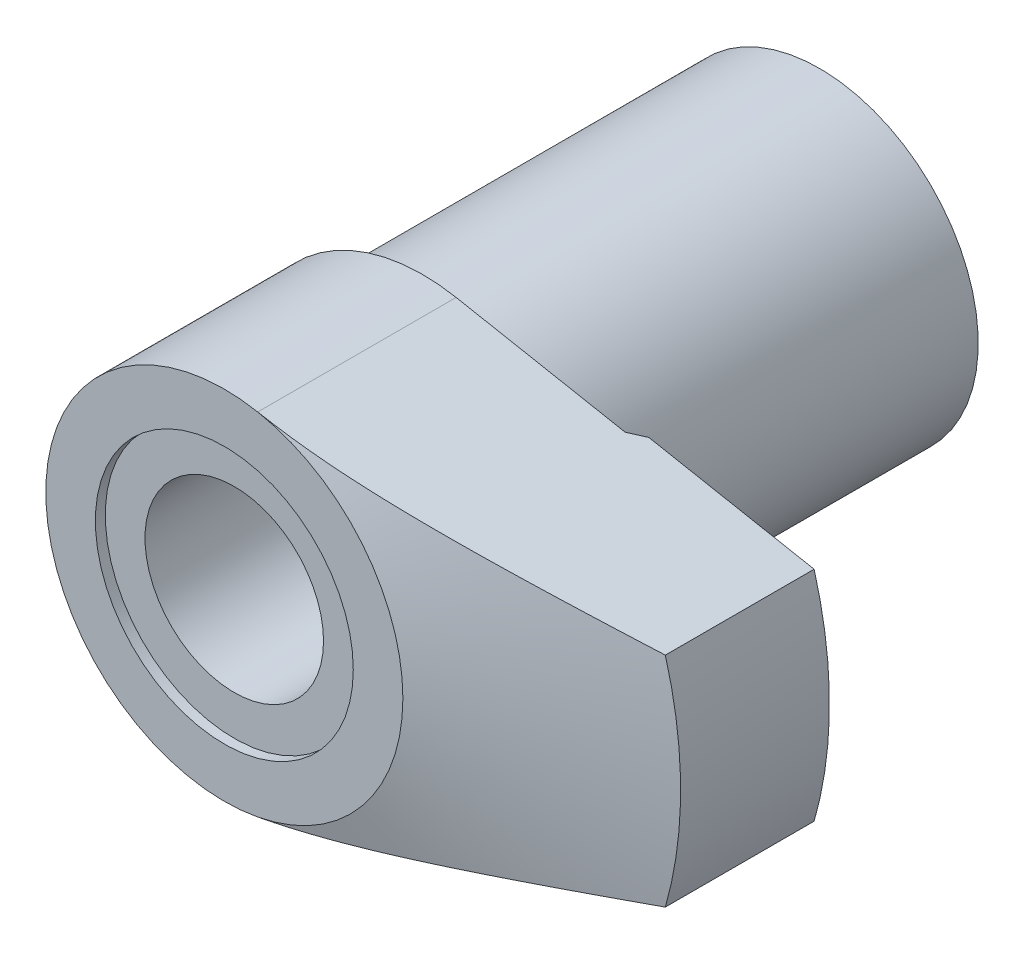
ISO-10303-21;
HEADER;
FILE_DESCRIPTION(('STEP AP214'),'2;1');
FILE_NAME('part.step','',(''),(''),'','','');
FILE_SCHEMA(('AUTOMOTIVE_DESIGN { 1 0 10303 214 1 1 1 1 }'));
ENDSEC;
DATA;
#1=APPLICATION_CONTEXT('core data for automotive mechanical design processes');
#2=APPLICATION_PROTOCOL_DEFINITION('international standard','automotive_design',2000,#1);
#3=PRODUCT_CONTEXT('',#1,'mechanical');
#4=PRODUCT('Part','Part','',(#3));
#5=PRODUCT_RELATED_PRODUCT_CATEGORY('part','',(#4));
#6=PRODUCT_DEFINITION_FORMATION('','',#4);
#7=PRODUCT_DEFINITION_CONTEXT('part definition',#1,'design');
#8=PRODUCT_DEFINITION('design','',#6,#7);
#9=PRODUCT_DEFINITION_SHAPE('','',#8);
#10=(LENGTH_UNIT() NAMED_UNIT(*) SI_UNIT(.MILLI.,.METRE.));
#11=(NAMED_UNIT(*) PLANE_ANGLE_UNIT() SI_UNIT($,.RADIAN.));
#12=(NAMED_UNIT(*) SI_UNIT($,.STERADIAN.) SOLID_ANGLE_UNIT());
#13=UNCERTAINTY_MEASURE_WITH_UNIT(LENGTH_MEASURE(1.E-05),#10,'distance_accuracy_value','');
#14=(GEOMETRIC_REPRESENTATION_CONTEXT(3) GLOBAL_UNCERTAINTY_ASSIGNED_CONTEXT((#13)) GLOBAL_UNIT_ASSIGNED_CONTEXT((#10,
#11,#12)) REPRESENTATION_CONTEXT('',''));
#15=CARTESIAN_POINT('',(0.,0.,0.));
#16=DIRECTION('',(0.,0.,1.));
#17=DIRECTION('',(1.,0.,0.));
#18=AXIS2_PLACEMENT_3D('',#15,#16,#17);
#19=CARTESIAN_POINT('',(38.4577690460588,11.,60.));
#20=DIRECTION('',(-0.18706704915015,-0.982347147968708,0.));
#21=DIRECTION('',(0.982347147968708,-0.18706704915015,0.));
#22=AXIS2_PLACEMENT_3D('',#19,#20,#21);
#23=PLANE('',#22);
#24=DIRECTION('',(0.982347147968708,-0.18706704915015,0.));
#25=VECTOR('',#24,1.);
#26=CARTESIAN_POINT('',(3.36720688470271,17.6822486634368,40.));
#27=LINE('',#26,#25);
#28=CARTESIAN_POINT('',(3.36720688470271,17.6822486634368,40.));
#29=VERTEX_POINT('',#28);
#30=CARTESIAN_POINT('',(20.4102929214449,14.4367566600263,40.));
#31=VERTEX_POINT('',#30);
#32=EDGE_CURVE('E75',#29,#31,#27,.T.);
#33=ORIENTED_EDGE('',*,*,#32,.F.);
#34=DIRECTION('',(0.,0.,-1.));
#35=VECTOR('',#34,1.);
#36=CARTESIAN_POINT('',(3.36720688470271,17.6822486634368,60.));
#37=LINE('',#36,#35);
#38=CARTESIAN_POINT('',(3.3672068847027,17.6822486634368,60.));
#39=VERTEX_POINT('',#38);
#40=EDGE_CURVE('E79',#39,#29,#37,.T.);
#41=ORIENTED_EDGE('',*,*,#40,.F.);
#42=CARTESIAN_POINT('',(3.36700688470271,17.6822867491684,59.999999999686));
#43=CARTESIAN_POINT('',(3.74617143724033,17.6100829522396,60.0000170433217));
#44=CARTESIAN_POINT('',(4.12533376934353,17.5378795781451,59.9966168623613));
#45=CARTESIAN_POINT('',(4.88353400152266,17.3934965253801,59.9830982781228));
#46=CARTESIAN_POINT('',(5.26257190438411,17.3213168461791,59.9729800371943));
#47=CARTESIAN_POINT('',(6.02031137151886,17.1770215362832,59.9461454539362));
#48=CARTESIAN_POINT('',(6.39901300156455,17.1049058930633,59.9294310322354));
#49=CARTESIAN_POINT('',(7.15609074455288,16.9607365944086,59.889627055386));
#50=CARTESIAN_POINT('',(7.53446685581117,16.8886829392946,59.8665374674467));
#51=CARTESIAN_POINT('',(8.66762905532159,16.672896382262,59.7882071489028));
#52=CARTESIAN_POINT('',(9.42182029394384,16.5292767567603,59.7238544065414));
#53=CARTESIAN_POINT('',(10.9281433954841,16.2424296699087,59.573607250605));
#54=CARTESIAN_POINT('',(11.6802750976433,16.0992022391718,59.4877112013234));
#55=CARTESIAN_POINT('',(13.1799693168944,15.813617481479,59.2977850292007));
#56=CARTESIAN_POINT('',(13.9275387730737,15.671258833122,59.1938111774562));
#57=CARTESIAN_POINT('',(15.4204330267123,15.3869689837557,58.9705298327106));
#58=CARTESIAN_POINT('',(16.1657578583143,15.2450377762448,58.8512225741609));
#59=CARTESIAN_POINT('',(17.6547023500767,14.9615000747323,58.5998721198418));
#60=CARTESIAN_POINT('',(18.398320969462,14.8198937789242,58.4678225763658));
#61=CARTESIAN_POINT('',(19.8836918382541,14.5370365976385,58.1933051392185));
#62=CARTESIAN_POINT('',(20.6254440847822,14.395785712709,58.0508372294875));
#63=CARTESIAN_POINT('',(22.0819191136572,14.1184311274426,57.7623832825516));
#64=CARTESIAN_POINT('',(22.796697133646,13.9823169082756,57.6166850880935));
#65=CARTESIAN_POINT('',(24.2249196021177,13.7103424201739,57.3186921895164));
#66=CARTESIAN_POINT('',(24.9383640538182,13.5744821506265,57.1663975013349));
#67=CARTESIAN_POINT('',(26.3639555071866,13.3030086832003,56.8563598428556));
#68=CARTESIAN_POINT('',(27.0761027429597,13.1673954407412,56.6986179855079));
#69=CARTESIAN_POINT('',(28.4994050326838,12.8963578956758,56.3785599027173));
#70=CARTESIAN_POINT('',(29.2105600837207,12.7609335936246,56.2162436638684));
#71=CARTESIAN_POINT('',(30.6340798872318,12.4898546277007,55.8872925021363));
#72=CARTESIAN_POINT('',(31.3464421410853,12.3542004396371,55.7206463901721));
#73=CARTESIAN_POINT('',(32.7704223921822,12.0830337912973,55.3840902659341));
#74=CARTESIAN_POINT('',(33.482040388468,11.9475213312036,55.2141802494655));
#75=CARTESIAN_POINT('',(34.904700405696,11.6766060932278,54.8715742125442));
#76=CARTESIAN_POINT('',(35.6157423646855,11.5412033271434,54.6988779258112));
#77=CARTESIAN_POINT('',(37.0372592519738,11.2705057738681,54.3511037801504));
#78=CARTESIAN_POINT('',(37.7477341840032,11.1352109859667,54.1760259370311));
#79=CARTESIAN_POINT('',(38.4579690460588,10.9999619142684,53.9999504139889));
#80=B_SPLINE_CURVE_WITH_KNOTS('',3,(#42,#43,#44,#45,#46,#47,#48,#49,#50,#51,#52,#53,#54,#55,#56,
#57,#58,#59,#60,#61,#62,#63,#64,#65,#66,#67,#68,#69,#70,#71,#72,#73,#74,#75,#76,#77,#78,#79),
.UNSPECIFIED.,.F.,.F.,(4,2,2,2,2,2,2,2,2,2,2,2,2,2,2,2,2,2,4),(0.,1.15791573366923,
2.31580348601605,3.47335434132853,4.63091115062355,6.94183624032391,9.25293684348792,
11.5569683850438,13.8609647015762,16.1661147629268,18.4712683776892,20.6974317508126,
22.9235897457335,25.1492955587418,27.3750078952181,29.6071945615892,31.8393840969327,
34.071788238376,36.3041775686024),.UNSPECIFIED.);
#81=CARTESIAN_POINT('',(38.4577690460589,11.,54.));
#82=VERTEX_POINT('',#81);
#83=EDGE_CURVE('E129',#39,#82,#80,.T.);
#84=ORIENTED_EDGE('',*,*,#83,.T.);
#85=DIRECTION('',(0.,0.,-1.));
#86=VECTOR('',#85,1.);
#87=CARTESIAN_POINT('',(38.4577690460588,11.,60.));
#88=LINE('',#87,#86);
#89=CARTESIAN_POINT('',(38.4577690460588,11.,39.));
#90=VERTEX_POINT('',#89);
#91=EDGE_CURVE('E98',#82,#90,#88,.T.);
#92=ORIENTED_EDGE('',*,*,#91,.T.);
#93=DIRECTION('',(-0.982347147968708,0.18706704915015,0.));
#94=VECTOR('',#93,1.);
#95=CARTESIAN_POINT('',(38.4577690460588,11.,39.));
#96=LINE('',#95,#94);
#97=CARTESIAN_POINT('',(21.7976730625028,14.1725597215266,39.));
#98=VERTEX_POINT('',#97);
#99=EDGE_CURVE('E141',#90,#98,#96,.T.);
#100=ORIENTED_EDGE('',*,*,#99,.T.);
#101=CARTESIAN_POINT('',(39.6395102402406,10.7749626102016,23.9221398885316));
#102=CARTESIAN_POINT('',(39.1146398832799,10.8749129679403,24.4023986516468));
#103=CARTESIAN_POINT('',(38.5888051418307,10.9750469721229,24.8815683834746));
#104=CARTESIAN_POINT('',(37.5349407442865,11.1757329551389,25.8374014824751));
#105=CARTESIAN_POINT('',(37.0069110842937,11.2762849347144,26.3140648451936));
#106=CARTESIAN_POINT('',(35.9482364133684,11.4778869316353,27.2646954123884));
#107=CARTESIAN_POINT('',(35.4175906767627,11.5789370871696,27.7386617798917));
#108=CARTESIAN_POINT('',(34.3535135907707,11.7815678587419,28.6833511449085));
#109=CARTESIAN_POINT('',(33.8200822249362,11.8831484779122,29.1540741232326));
#110=CARTESIAN_POINT('',(32.7450250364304,12.0878701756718,30.0962033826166));
#111=CARTESIAN_POINT('',(32.2033693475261,12.1910169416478,30.5675743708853));
#112=CARTESIAN_POINT('',(31.1163969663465,12.3980076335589,31.5058996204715));
#113=CARTESIAN_POINT('',(30.5710803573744,12.5018515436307,31.9728539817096));
#114=CARTESIAN_POINT('',(29.4763313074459,12.710323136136,32.9015335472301));
#115=CARTESIAN_POINT('',(28.926899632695,12.814950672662,33.3632596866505));
#116=CARTESIAN_POINT('',(27.8231284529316,13.0251403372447,34.2806981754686));
#117=CARTESIAN_POINT('',(27.2687885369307,13.1307025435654,34.7364100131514));
#118=CARTESIAN_POINT('',(26.2080043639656,13.3327062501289,35.597198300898));
#119=CARTESIAN_POINT('',(25.7020758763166,13.4290495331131,36.0029327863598));
#120=CARTESIAN_POINT('',(24.6849161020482,13.6227459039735,36.8074825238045));
#121=CARTESIAN_POINT('',(24.1736847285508,13.7200990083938,37.2062976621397));
#122=CARTESIAN_POINT('',(23.1451806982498,13.9159556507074,37.9956499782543));
#123=CARTESIAN_POINT('',(22.6279088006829,14.0144590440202,38.3861881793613));
#124=CARTESIAN_POINT('',(21.5863211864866,14.2128071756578,39.1573852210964));
#125=CARTESIAN_POINT('',(21.0620057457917,14.3126518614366,39.5380444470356));
#126=CARTESIAN_POINT('',(20.0061001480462,14.5137265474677,40.2867683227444));
#127=CARTESIAN_POINT('',(19.474524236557,14.6149538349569,40.6548537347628));
#128=CARTESIAN_POINT('',(18.4018654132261,14.8192188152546,41.3764959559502));
#129=CARTESIAN_POINT('',(17.8607820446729,14.9222565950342,41.7300520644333));
#130=CARTESIAN_POINT('',(16.7680387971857,15.1303462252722,42.418948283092));
#131=CARTESIAN_POINT('',(16.2163868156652,15.2353965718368,42.7543013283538));
#132=CARTESIAN_POINT('',(15.1005362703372,15.4478864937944,43.4026429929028));
#133=CARTESIAN_POINT('',(14.5363396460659,15.555325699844,43.715635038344));
#134=CARTESIAN_POINT('',(13.6907919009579,15.7163422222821,44.1581191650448));
#135=CARTESIAN_POINT('',(13.4148800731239,15.7688837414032,44.2984167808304));
#136=CARTESIAN_POINT('',(12.8596450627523,15.8746163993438,44.5717671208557));
#137=CARTESIAN_POINT('',(12.580322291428,15.9278074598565,44.7048207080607));
#138=CARTESIAN_POINT('',(12.0181003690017,16.0348706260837,44.9628698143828));
#139=CARTESIAN_POINT('',(11.7352012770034,16.0887427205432,45.0878654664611));
#140=CARTESIAN_POINT('',(11.1656430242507,16.1972029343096,45.3289189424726));
#141=CARTESIAN_POINT('',(10.8789825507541,16.2517913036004,45.4449735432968));
#142=CARTESIAN_POINT('',(10.0150658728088,16.4163057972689,45.7775493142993));
#143=CARTESIAN_POINT('',(9.43218264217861,16.5273034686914,45.9792708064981));
#144=CARTESIAN_POINT('',(8.25249193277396,16.7519503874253,46.3344392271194));
#145=CARTESIAN_POINT('',(7.65569138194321,16.8655983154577,46.4879096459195));
#146=CARTESIAN_POINT('',(6.54454524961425,17.0771923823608,46.7187348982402));
#147=CARTESIAN_POINT('',(6.03184171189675,17.1748258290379,46.8042238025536));
#148=CARTESIAN_POINT('',(5.00115294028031,17.3710985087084,46.9308088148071));
#149=CARTESIAN_POINT('',(4.48316846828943,17.4697375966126,46.9719112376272));
#150=CARTESIAN_POINT('',(3.44602027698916,17.6672403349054,47.0075494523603));
#151=CARTESIAN_POINT('',(2.92685767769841,17.7661037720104,47.0021188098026));
#152=CARTESIAN_POINT('',(1.89092508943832,17.9633750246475,46.9450493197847));
#153=CARTESIAN_POINT('',(1.37415538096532,18.0617827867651,46.8934051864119));
#154=CARTESIAN_POINT('',(0.539125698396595,18.2207963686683,46.7741160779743));
#155=CARTESIAN_POINT('',(0.218966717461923,18.281763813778,46.719696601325));
#156=CARTESIAN_POINT('',(-0.418342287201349,18.4031257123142,46.5948720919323));
#157=CARTESIAN_POINT('',(-0.735492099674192,18.4635201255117,46.5244659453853));
#158=CARTESIAN_POINT('',(-1.68178154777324,18.6437207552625,46.2909440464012));
#159=CARTESIAN_POINT('',(-2.30568252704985,18.762529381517,46.1055365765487));
#160=CARTESIAN_POINT('',(-3.54092429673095,18.9977548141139,45.6842311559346));
#161=CARTESIAN_POINT('',(-4.15215747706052,19.1141511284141,45.4480137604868));
#162=CARTESIAN_POINT('',(-5.35800549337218,19.3437791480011,44.9356310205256));
#163=CARTESIAN_POINT('',(-5.95262226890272,19.4570112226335,44.6594703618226));
#164=CARTESIAN_POINT('',(-6.98949938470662,19.6544623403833,44.143551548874));
#165=CARTESIAN_POINT('',(-7.43494013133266,19.7392870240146,43.9103318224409));
#166=CARTESIAN_POINT('',(-8.31753020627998,19.9073574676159,43.4282483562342));
#167=CARTESIAN_POINT('',(-8.75467992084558,19.9906033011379,43.1793853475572));
#168=CARTESIAN_POINT('',(-9.61536148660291,20.1545017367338,42.6721395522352));
#169=CARTESIAN_POINT('',(-10.0389984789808,20.2351743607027,42.413940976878));
#170=CARTESIAN_POINT('',(-10.669486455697,20.3552373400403,42.0185885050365));
#171=CARTESIAN_POINT('',(-10.8787980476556,20.3950962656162,41.8854772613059));
#172=CARTESIAN_POINT('',(-11.2958668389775,20.4745181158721,41.6167685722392));
#173=CARTESIAN_POINT('',(-11.5036240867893,20.5140810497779,41.4811712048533));
#174=CARTESIAN_POINT('',(-11.7106532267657,20.5535053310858,41.3444302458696));
#175=B_SPLINE_CURVE_WITH_KNOTS('',3,(#101,#102,#103,#104,#105,#106,#107,#108,#109,#110,#111,
#112,#113,#114,#115,#116,#117,#118,#119,#120,#121,#122,#123,#124,#125,#126,#127,#128,#129,#130,
#131,#132,#133,#134,#135,#136,#137,#138,#139,#140,#141,#142,#143,#144,#145,#146,#147,#148,#149,
#150,#151,#152,#153,#154,#155,#156,#157,#158,#159,#160,#161,#162,#163,#164,#165,#166,#167,#168,
#169,#170,#171,#172,#173,#174),.UNSPECIFIED.,.F.,.F.,(4,2,2,2,2,2,2,2,2,2,2,2,2,2,2,2,2,2,2,2,2,
2,2,2,2,2,2,2,2,2,2,2,2,2,2,2,4),(0.,2.15526194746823,4.31052772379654,6.46642939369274,
8.62234380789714,10.7985561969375,12.9747192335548,15.1504866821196,17.3264380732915,
19.2933140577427,21.2602223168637,23.2268859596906,25.1934727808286,27.156637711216,
29.1198972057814,31.0817428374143,33.0432872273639,33.9850855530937,34.926771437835,
35.8684417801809,36.8104500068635,38.6887950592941,40.5662242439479,42.1511135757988,
43.7357773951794,45.3192982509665,46.9030002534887,47.8938931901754,48.8848551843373,
50.8670209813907,52.862033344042,54.8568118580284,56.386208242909,57.9155332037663,
59.4232479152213,60.176936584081,60.9306016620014),.UNSPECIFIED.);
#176=EDGE_CURVE('E82',#98,#31,#175,.T.);
#177=ORIENTED_EDGE('',*,*,#176,.T.);
#178=EDGE_LOOP('',(#33,#41,#84,#92,#100,#177));
#179=FACE_BOUND('',#178,.T.);
#180=ADVANCED_FACE('F14',(#179),#23,.F.);
#181=CARTESIAN_POINT('',(38.4577690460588,-11.,60.));
#182=DIRECTION('',(0.18706704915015,-0.982347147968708,0.));
#183=DIRECTION('',(0.982347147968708,0.18706704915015,0.));
#184=AXIS2_PLACEMENT_3D('',#181,#182,#183);
#185=PLANE('',#184);
#186=DIRECTION('',(0.,0.,-1.));
#187=VECTOR('',#186,1.);
#188=CARTESIAN_POINT('',(3.3672068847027,-17.6822486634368,60.));
#189=LINE('',#188,#187);
#190=CARTESIAN_POINT('',(3.3672068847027,-17.6822486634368,60.));
#191=VERTEX_POINT('',#190);
#192=CARTESIAN_POINT('',(3.3672068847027,-17.6822486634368,40.));
#193=VERTEX_POINT('',#192);
#194=EDGE_CURVE('E99',#191,#193,#189,.T.);
#195=ORIENTED_EDGE('',*,*,#194,.T.);
#196=DIRECTION('',(-0.982347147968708,-0.187067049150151,0.));
#197=VECTOR('',#196,1.);
#198=CARTESIAN_POINT('',(20.410292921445,-14.4367566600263,40.));
#199=LINE('',#198,#197);
#200=CARTESIAN_POINT('',(20.410292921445,-14.4367566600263,40.));
#201=VERTEX_POINT('',#200);
#202=EDGE_CURVE('E85',#201,#193,#199,.T.);
#203=ORIENTED_EDGE('',*,*,#202,.F.);
#204=CARTESIAN_POINT('',(39.6395102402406,-10.7749626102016,23.9221398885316));
#205=CARTESIAN_POINT('',(39.1146398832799,-10.8749129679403,24.4023986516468));
#206=CARTESIAN_POINT('',(38.5888051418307,-10.9750469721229,24.8815683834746));
#207=CARTESIAN_POINT('',(37.5349407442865,-11.1757329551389,25.8374014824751));
#208=CARTESIAN_POINT('',(37.0069110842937,-11.2762849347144,26.3140648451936));
#209=CARTESIAN_POINT('',(35.9482364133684,-11.4778869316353,27.2646954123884));
#210=CARTESIAN_POINT('',(35.4175906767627,-11.5789370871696,27.7386617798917));
#211=CARTESIAN_POINT('',(34.3535135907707,-11.7815678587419,28.6833511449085));
#212=CARTESIAN_POINT('',(33.8200822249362,-11.8831484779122,29.1540741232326));
#213=CARTESIAN_POINT('',(32.7450250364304,-12.0878701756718,30.0962033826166));
#214=CARTESIAN_POINT('',(32.2033693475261,-12.1910169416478,30.5675743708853));
#215=CARTESIAN_POINT('',(31.1163969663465,-12.3980076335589,31.5058996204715));
#216=CARTESIAN_POINT('',(30.5710803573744,-12.5018515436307,31.9728539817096));
#217=CARTESIAN_POINT('',(29.4763313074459,-12.710323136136,32.9015335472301));
#218=CARTESIAN_POINT('',(28.926899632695,-12.814950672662,33.3632596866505));
#219=CARTESIAN_POINT('',(27.8231284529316,-13.0251403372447,34.2806981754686));
#220=CARTESIAN_POINT('',(27.2687885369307,-13.1307025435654,34.7364100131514));
#221=CARTESIAN_POINT('',(26.2080043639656,-13.3327062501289,35.597198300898));
#222=CARTESIAN_POINT('',(25.7020758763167,-13.4290495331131,36.0029327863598));
#223=CARTESIAN_POINT('',(24.6849161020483,-13.6227459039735,36.8074825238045));
#224=CARTESIAN_POINT('',(24.1736847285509,-13.7200990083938,37.2062976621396));
#225=CARTESIAN_POINT('',(23.1451806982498,-13.9159556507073,37.9956499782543));
#226=CARTESIAN_POINT('',(22.6279088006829,-14.0144590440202,38.3861881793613));
#227=CARTESIAN_POINT('',(21.5863211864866,-14.2128071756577,39.1573852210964));
#228=CARTESIAN_POINT('',(21.0620057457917,-14.3126518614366,39.5380444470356));
#229=CARTESIAN_POINT('',(20.0061001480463,-14.5137265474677,40.2867683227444));
#230=CARTESIAN_POINT('',(19.474524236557,-14.6149538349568,40.6548537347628));
#231=CARTESIAN_POINT('',(18.4018654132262,-14.8192188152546,41.3764959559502));
#232=CARTESIAN_POINT('',(17.860782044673,-14.9222565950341,41.7300520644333));
#233=CARTESIAN_POINT('',(16.7680387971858,-15.1303462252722,42.418948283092));
#234=CARTESIAN_POINT('',(16.2163868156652,-15.2353965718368,42.7543013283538));
#235=CARTESIAN_POINT('',(15.1005362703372,-15.4478864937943,43.4026429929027));
#236=CARTESIAN_POINT('',(14.536339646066,-15.555325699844,43.715635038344));
#237=CARTESIAN_POINT('',(13.690791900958,-15.7163422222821,44.1581191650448));
#238=CARTESIAN_POINT('',(13.414880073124,-15.7688837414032,44.2984167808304));
#239=CARTESIAN_POINT('',(12.8596450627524,-15.8746163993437,44.5717671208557));
#240=CARTESIAN_POINT('',(12.5803222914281,-15.9278074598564,44.7048207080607));
#241=CARTESIAN_POINT('',(12.0181003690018,-16.0348706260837,44.9628698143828));
#242=CARTESIAN_POINT('',(11.7352012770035,-16.0887427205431,45.087865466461));
#243=CARTESIAN_POINT('',(11.1656430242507,-16.1972029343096,45.3289189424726));
#244=CARTESIAN_POINT('',(10.8789825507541,-16.2517913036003,45.4449735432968));
#245=CARTESIAN_POINT('',(10.0150658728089,-16.4163057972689,45.7775493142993));
#246=CARTESIAN_POINT('',(9.43218264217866,-16.5273034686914,45.9792708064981));
#247=CARTESIAN_POINT('',(8.252491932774,-16.7519503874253,46.3344392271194));
#248=CARTESIAN_POINT('',(7.65569138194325,-16.8655983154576,46.4879096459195));
#249=CARTESIAN_POINT('',(6.5445452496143,-17.0771923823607,46.7187348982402));
#250=CARTESIAN_POINT('',(6.0318417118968,-17.1748258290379,46.8042238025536));
#251=CARTESIAN_POINT('',(5.00115294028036,-17.3710985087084,46.9308088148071));
#252=CARTESIAN_POINT('',(4.48316846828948,-17.4697375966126,46.9719112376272));
#253=CARTESIAN_POINT('',(3.44602027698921,-17.6672403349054,47.0075494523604));
#254=CARTESIAN_POINT('',(2.92685767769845,-17.7661037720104,47.0021188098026));
#255=CARTESIAN_POINT('',(1.89092508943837,-17.9633750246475,46.9450493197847));
#256=CARTESIAN_POINT('',(1.37415538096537,-18.0617827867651,46.8934051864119));
#257=CARTESIAN_POINT('',(0.539125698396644,-18.2207963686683,46.7741160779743));
#258=CARTESIAN_POINT('',(0.218966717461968,-18.2817638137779,46.719696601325));
#259=CARTESIAN_POINT('',(-0.418342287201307,-18.4031257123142,46.5948720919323));
#260=CARTESIAN_POINT('',(-0.735492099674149,-18.4635201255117,46.5244659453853));
#261=CARTESIAN_POINT('',(-1.68178154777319,-18.6437207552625,46.2909440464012));
#262=CARTESIAN_POINT('',(-2.3056825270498,-18.7625293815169,46.1055365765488));
#263=CARTESIAN_POINT('',(-3.54092429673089,-18.9977548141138,45.6842311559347));
#264=CARTESIAN_POINT('',(-4.15215747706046,-19.1141511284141,45.4480137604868));
#265=CARTESIAN_POINT('',(-5.35800549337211,-19.3437791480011,44.9356310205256));
#266=CARTESIAN_POINT('',(-5.95262226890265,-19.4570112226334,44.6594703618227));
#267=CARTESIAN_POINT('',(-6.98949938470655,-19.6544623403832,44.1435515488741));
#268=CARTESIAN_POINT('',(-7.4349401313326,-19.7392870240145,43.9103318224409));
#269=CARTESIAN_POINT('',(-8.31753020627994,-19.9073574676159,43.4282483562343));
#270=CARTESIAN_POINT('',(-8.75467992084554,-19.9906033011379,43.1793853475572));
#271=CARTESIAN_POINT('',(-9.61536148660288,-20.1545017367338,42.6721395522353));
#272=CARTESIAN_POINT('',(-10.0389984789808,-20.2351743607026,42.413940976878));
#273=CARTESIAN_POINT('',(-10.669486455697,-20.3552373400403,42.0185885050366));
#274=CARTESIAN_POINT('',(-10.8787980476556,-20.3950962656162,41.8854772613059));
#275=CARTESIAN_POINT('',(-11.2958668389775,-20.474518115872,41.6167685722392));
#276=CARTESIAN_POINT('',(-11.5036240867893,-20.5140810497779,41.4811712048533));
#277=CARTESIAN_POINT('',(-11.7106532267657,-20.5535053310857,41.3444302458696));
#278=B_SPLINE_CURVE_WITH_KNOTS('',3,(#204,#205,#206,#207,#208,#209,#210,#211,#212,#213,#214,
#215,#216,#217,#218,#219,#220,#221,#222,#223,#224,#225,#226,#227,#228,#229,#230,#231,#232,#233,
#234,#235,#236,#237,#238,#239,#240,#241,#242,#243,#244,#245,#246,#247,#248,#249,#250,#251,#252,
#253,#254,#255,#256,#257,#258,#259,#260,#261,#262,#263,#264,#265,#266,#267,#268,#269,#270,#271,
#272,#273,#274,#275,#276,#277),.UNSPECIFIED.,.F.,.F.,(4,2,2,2,2,2,2,2,2,2,2,2,2,2,2,2,2,2,2,2,2,
2,2,2,2,2,2,2,2,2,2,2,2,2,2,2,4),(0.,2.15526194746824,4.31052772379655,6.46642939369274,
8.62234380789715,10.7985561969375,12.9747192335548,15.1504866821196,17.3264380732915,
19.2933140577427,21.2602223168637,23.2268859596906,25.1934727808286,27.1566377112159,
29.1198972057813,31.0817428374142,33.0432872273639,33.9850855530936,34.9267714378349,
35.8684417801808,36.8104500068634,38.6887950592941,40.5662242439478,42.1511135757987,
43.7357773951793,45.3192982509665,46.9030002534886,47.8938931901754,48.8848551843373,
50.8670209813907,52.862033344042,54.8568118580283,56.3862082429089,57.9155332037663,
59.4232479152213,60.176936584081,60.9306016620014),.UNSPECIFIED.);
#279=CARTESIAN_POINT('',(21.7976730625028,-14.1725597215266,39.));
#280=VERTEX_POINT('',#279);
#281=EDGE_CURVE('E9',#280,#201,#278,.T.);
#282=ORIENTED_EDGE('',*,*,#281,.F.);
#283=DIRECTION('',(-0.982347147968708,-0.18706704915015,0.));
#284=VECTOR('',#283,1.);
#285=CARTESIAN_POINT('',(38.4577690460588,-11.,39.));
#286=LINE('',#285,#284);
#287=CARTESIAN_POINT('',(38.4577690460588,-11.,39.));
#288=VERTEX_POINT('',#287);
#289=EDGE_CURVE('E101',#288,#280,#286,.T.);
#290=ORIENTED_EDGE('',*,*,#289,.F.);
#291=DIRECTION('',(0.,0.,-1.));
#292=VECTOR('',#291,1.);
#293=CARTESIAN_POINT('',(38.4577690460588,-11.,60.));
#294=LINE('',#293,#292);
#295=CARTESIAN_POINT('',(38.4577690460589,-11.,54.));
#296=VERTEX_POINT('',#295);
#297=EDGE_CURVE('E42',#296,#288,#294,.T.);
#298=ORIENTED_EDGE('',*,*,#297,.F.);
#299=CARTESIAN_POINT('',(3.3670068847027,-17.6822867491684,59.999999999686));
#300=CARTESIAN_POINT('',(3.74617143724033,-17.6100829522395,60.0000170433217));
#301=CARTESIAN_POINT('',(4.12533376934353,-17.537879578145,59.9966168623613));
#302=CARTESIAN_POINT('',(4.88353400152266,-17.39349652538,59.9830982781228));
#303=CARTESIAN_POINT('',(5.26257190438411,-17.3213168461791,59.9729800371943));
#304=CARTESIAN_POINT('',(6.02031137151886,-17.1770215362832,59.9461454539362));
#305=CARTESIAN_POINT('',(6.39901300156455,-17.1049058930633,59.9294310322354));
#306=CARTESIAN_POINT('',(7.15609074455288,-16.9607365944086,59.889627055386));
#307=CARTESIAN_POINT('',(7.53446685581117,-16.8886829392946,59.8665374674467));
#308=CARTESIAN_POINT('',(8.66762905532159,-16.672896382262,59.7882071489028));
#309=CARTESIAN_POINT('',(9.42182029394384,-16.5292767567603,59.7238544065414));
#310=CARTESIAN_POINT('',(10.9281433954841,-16.2424296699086,59.573607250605));
#311=CARTESIAN_POINT('',(11.6802750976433,-16.0992022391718,59.4877112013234));
#312=CARTESIAN_POINT('',(13.1799693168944,-15.813617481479,59.2977850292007));
#313=CARTESIAN_POINT('',(13.9275387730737,-15.671258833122,59.1938111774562));
#314=CARTESIAN_POINT('',(15.4204330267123,-15.3869689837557,58.9705298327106));
#315=CARTESIAN_POINT('',(16.1657578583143,-15.2450377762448,58.851222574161));
#316=CARTESIAN_POINT('',(17.6547023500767,-14.9615000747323,58.5998721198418));
#317=CARTESIAN_POINT('',(18.398320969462,-14.8198937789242,58.4678225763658));
#318=CARTESIAN_POINT('',(19.8836918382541,-14.5370365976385,58.1933051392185));
#319=CARTESIAN_POINT('',(20.6254440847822,-14.395785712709,58.0508372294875));
#320=CARTESIAN_POINT('',(22.0819191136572,-14.1184311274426,57.7623832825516));
#321=CARTESIAN_POINT('',(22.796697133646,-13.9823169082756,57.6166850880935));
#322=CARTESIAN_POINT('',(24.2249196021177,-13.7103424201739,57.3186921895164));
#323=CARTESIAN_POINT('',(24.9383640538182,-13.5744821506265,57.1663975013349));
#324=CARTESIAN_POINT('',(26.3639555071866,-13.3030086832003,56.8563598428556));
#325=CARTESIAN_POINT('',(27.0761027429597,-13.1673954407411,56.6986179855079));
#326=CARTESIAN_POINT('',(28.4994050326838,-12.8963578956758,56.3785599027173));
#327=CARTESIAN_POINT('',(29.2105600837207,-12.7609335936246,56.2162436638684));
#328=CARTESIAN_POINT('',(30.6340798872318,-12.4898546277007,55.8872925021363));
#329=CARTESIAN_POINT('',(31.3464421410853,-12.3542004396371,55.7206463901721));
#330=CARTESIAN_POINT('',(32.7704223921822,-12.0830337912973,55.3840902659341));
#331=CARTESIAN_POINT('',(33.482040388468,-11.9475213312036,55.2141802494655));
#332=CARTESIAN_POINT('',(34.904700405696,-11.6766060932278,54.8715742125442));
#333=CARTESIAN_POINT('',(35.6157423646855,-11.5412033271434,54.6988779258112));
#334=CARTESIAN_POINT('',(37.0372592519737,-11.2705057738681,54.3511037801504));
#335=CARTESIAN_POINT('',(37.7477341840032,-11.1352109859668,54.1760259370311));
#336=CARTESIAN_POINT('',(38.4579690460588,-10.9999619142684,53.9999504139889));
#337=B_SPLINE_CURVE_WITH_KNOTS('',3,(#299,#300,#301,#302,#303,#304,#305,#306,#307,#308,#309,
#310,#311,#312,#313,#314,#315,#316,#317,#318,#319,#320,#321,#322,#323,#324,#325,#326,#327,#328,
#329,#330,#331,#332,#333,#334,#335,#336),.UNSPECIFIED.,.F.,.F.,(4,2,2,2,2,2,2,2,2,2,2,2,2,2,2,2,
2,2,4),(0.,1.15791573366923,2.31580348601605,3.47335434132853,4.63091115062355,6.94183624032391,
9.25293684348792,11.5569683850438,13.8609647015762,16.1661147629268,18.4712683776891,
20.6974317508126,22.9235897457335,25.1492955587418,27.3750078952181,29.6071945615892,
31.8393840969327,34.0717882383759,36.3041775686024),.UNSPECIFIED.);
#338=EDGE_CURVE('E28',#191,#296,#337,.T.);
#339=ORIENTED_EDGE('',*,*,#338,.F.);
#340=EDGE_LOOP('',(#195,#203,#282,#290,#298,#339));
#341=FACE_BOUND('',#340,.T.);
#342=ADVANCED_FACE('F114',(#341),#185,.T.);
#343=CARTESIAN_POINT('',(0.,0.,60.));
#344=DIRECTION('',(0.,0.,-1.));
#345=DIRECTION('',(-1.,0.,0.));
#346=AXIS2_PLACEMENT_3D('',#343,#344,#345);
#347=CYLINDRICAL_SURFACE('',#346,18.);
#348=CARTESIAN_POINT('',(0.,0.,40.));
#349=DIRECTION('',(0.,0.,1.));
#350=DIRECTION('',(1.,0.,0.));
#351=AXIS2_PLACEMENT_3D('',#348,#349,#350);
#352=CIRCLE('',#351,18.);
#353=EDGE_CURVE('E88',#29,#193,#352,.T.);
#354=ORIENTED_EDGE('',*,*,#353,.T.);
#355=ORIENTED_EDGE('',*,*,#194,.F.);
#356=CARTESIAN_POINT('',(0.,0.,60.));
#357=DIRECTION('',(0.,0.,1.));
#358=DIRECTION('',(1.,0.,0.));
#359=AXIS2_PLACEMENT_3D('',#356,#357,#358);
#360=CIRCLE('',#359,18.);
#361=EDGE_CURVE('E97',#39,#191,#360,.T.);
#362=ORIENTED_EDGE('',*,*,#361,.F.);
#363=ORIENTED_EDGE('',*,*,#40,.T.);
#364=EDGE_LOOP('',(#354,#355,#362,#363));
#365=FACE_BOUND('',#364,.T.);
#366=ADVANCED_FACE('F96',(#365),#347,.T.);
#367=CARTESIAN_POINT('',(50.,20.,39.));
#368=DIRECTION('',(0.,0.,1.));
#369=DIRECTION('',(1.,0.,0.));
#370=AXIS2_PLACEMENT_3D('',#367,#368,#369);
#371=PLANE('',#370);
#372=ORIENTED_EDGE('',*,*,#289,.T.);
#373=CARTESIAN_POINT('',(0.,0.,39.));
#374=DIRECTION('',(0.,0.,1.));
#375=DIRECTION('',(1.,0.,0.));
#376=AXIS2_PLACEMENT_3D('',#373,#374,#375);
#377=CIRCLE('',#376,26.);
#378=EDGE_CURVE('E34',#280,#98,#377,.T.);
#379=ORIENTED_EDGE('',*,*,#378,.T.);
#380=ORIENTED_EDGE('',*,*,#99,.F.);
#381=CARTESIAN_POINT('',(0.,0.,39.));
#382=DIRECTION('',(0.,0.,1.));
#383=DIRECTION('',(1.,0.,0.));
#384=AXIS2_PLACEMENT_3D('',#381,#382,#383);
#385=CIRCLE('',#384,40.);
#386=EDGE_CURVE('E143',#288,#90,#385,.T.);
#387=ORIENTED_EDGE('',*,*,#386,.F.);
#388=EDGE_LOOP('',(#372,#379,#380,#387));
#389=FACE_BOUND('',#388,.T.);
#390=ADVANCED_FACE('F157',(#389),#371,.F.);
#391=CARTESIAN_POINT('',(0.,0.,60.));
#392=DIRECTION('',(0.,0.,-1.));
#393=DIRECTION('',(-1.,0.,0.));
#394=AXIS2_PLACEMENT_3D('',#391,#392,#393);
#395=CYLINDRICAL_SURFACE('',#394,9.);
#396=CARTESIAN_POINT('',(0.,0.,0.));
#397=DIRECTION('',(0.,0.,1.));
#398=DIRECTION('',(1.,0.,0.));
#399=AXIS2_PLACEMENT_3D('',#396,#397,#398);
#400=CIRCLE('',#399,9.);
#401=CARTESIAN_POINT('',(9.,0.,0.));
#402=VERTEX_POINT('',#401);
#403=EDGE_CURVE('E145',#402,#402,#400,.T.);
#404=ORIENTED_EDGE('',*,*,#403,.F.);
#405=EDGE_LOOP('',(#404));
#406=FACE_BOUND('',#405,.T.);
#407=CARTESIAN_POINT('',(0.,0.,59.));
#408=DIRECTION('',(0.,0.,1.));
#409=DIRECTION('',(1.,0.,0.));
#410=AXIS2_PLACEMENT_3D('',#407,#408,#409);
#411=CIRCLE('',#410,9.);
#412=CARTESIAN_POINT('',(9.,0.,59.));
#413=VERTEX_POINT('',#412);
#414=EDGE_CURVE('E113',#413,#413,#411,.T.);
#415=ORIENTED_EDGE('',*,*,#414,.T.);
#416=EDGE_LOOP('',(#415));
#417=FACE_BOUND('',#416,.T.);
#418=ADVANCED_FACE('F185',(#406,#417),#395,.F.);
#419=CARTESIAN_POINT('',(0.,0.,0.));
#420=DIRECTION('',(0.,0.,1.));
#421=DIRECTION('',(1.,0.,0.));
#422=AXIS2_PLACEMENT_3D('',#419,#420,#421);
#423=PLANE('',#422);
#424=ORIENTED_EDGE('',*,*,#403,.T.);
#425=EDGE_LOOP('',(#424));
#426=FACE_BOUND('',#425,.T.);
#427=CARTESIAN_POINT('',(0.,0.,0.));
#428=DIRECTION('',(0.,0.,-1.));
#429=DIRECTION('',(-1.,0.,0.));
#430=AXIS2_PLACEMENT_3D('',#427,#428,#429);
#431=CIRCLE('',#430,16.);
#432=CARTESIAN_POINT('',(-16.,0.,0.));
#433=VERTEX_POINT('',#432);
#434=EDGE_CURVE('E136',#433,#433,#431,.T.);
#435=ORIENTED_EDGE('',*,*,#434,.T.);
#436=EDGE_LOOP('',(#435));
#437=FACE_BOUND('',#436,.T.);
#438=ADVANCED_FACE('F169',(#426,#437),#423,.F.);
#439=CARTESIAN_POINT('',(0.,0.,60.));
#440=DIRECTION('',(0.,0.,1.));
#441=DIRECTION('',(1.,0.,0.));
#442=AXIS2_PLACEMENT_3D('',#439,#440,#441);
#443=PLANE('',#442);
#444=CARTESIAN_POINT('',(0.,0.,60.));
#445=DIRECTION('',(0.,0.,1.));
#446=DIRECTION('',(1.,0.,0.));
#447=AXIS2_PLACEMENT_3D('',#444,#445,#446);
#448=CIRCLE('',#447,13.);
#449=CARTESIAN_POINT('',(13.,0.,60.));
#450=VERTEX_POINT('',#449);
#451=EDGE_CURVE('E205',#450,#450,#448,.T.);
#452=ORIENTED_EDGE('',*,*,#451,.F.);
#453=EDGE_LOOP('',(#452));
#454=FACE_BOUND('',#453,.T.);
#455=CARTESIAN_POINT('',(0.,0.,60.));
#456=DIRECTION('',(0.,0.,1.));
#457=DIRECTION('',(1.,0.,0.));
#458=AXIS2_PLACEMENT_3D('',#455,#456,#457);
#459=CIRCLE('',#458,18.);
#460=EDGE_CURVE('E152',#191,#39,#459,.T.);
#461=ORIENTED_EDGE('',*,*,#460,.T.);
#462=ORIENTED_EDGE('',*,*,#361,.T.);
#463=EDGE_LOOP('',(#461,#462));
#464=FACE_BOUND('',#463,.T.);
#465=ADVANCED_FACE('F151',(#454,#464),#443,.T.);
#466=CARTESIAN_POINT('',(0.,0.,60.));
#467=DIRECTION('',(0.,0.,-1.));
#468=DIRECTION('',(-1.,0.,0.));
#469=AXIS2_PLACEMENT_3D('',#466,#467,#468);
#470=CYLINDRICAL_SURFACE('',#469,40.);
#471=ORIENTED_EDGE('',*,*,#91,.F.);
#472=CARTESIAN_POINT('',(0.,0.,54.));
#473=DIRECTION('',(0.,0.,1.));
#474=DIRECTION('',(1.,0.,0.));
#475=AXIS2_PLACEMENT_3D('',#472,#473,#474);
#476=CIRCLE('',#475,40.);
#477=EDGE_CURVE('E137',#296,#82,#476,.T.);
#478=ORIENTED_EDGE('',*,*,#477,.F.);
#479=ORIENTED_EDGE('',*,*,#297,.T.);
#480=ORIENTED_EDGE('',*,*,#386,.T.);
#481=EDGE_LOOP('',(#471,#478,#479,#480));
#482=FACE_BOUND('',#481,.T.);
#483=ADVANCED_FACE('F160',(#482),#470,.T.);
#484=CARTESIAN_POINT('',(0.,0.,39.));
#485=DIRECTION('',(0.,0.,-1.));
#486=DIRECTION('',(-1.,0.,0.));
#487=AXIS2_PLACEMENT_3D('',#484,#485,#486);
#488=CYLINDRICAL_SURFACE('',#487,16.);
#489=ORIENTED_EDGE('',*,*,#434,.F.);
#490=EDGE_LOOP('',(#489));
#491=FACE_BOUND('',#490,.T.);
#492=CARTESIAN_POINT('',(0.,0.,40.));
#493=DIRECTION('',(0.,0.,1.));
#494=DIRECTION('',(1.,0.,0.));
#495=AXIS2_PLACEMENT_3D('',#492,#493,#494);
#496=CIRCLE('',#495,16.);
#497=CARTESIAN_POINT('',(16.,0.,40.));
#498=VERTEX_POINT('',#497);
#499=EDGE_CURVE('E94',#498,#498,#496,.T.);
#500=ORIENTED_EDGE('',*,*,#499,.F.);
#501=EDGE_LOOP('',(#500));
#502=FACE_BOUND('',#501,.T.);
#503=ADVANCED_FACE('F123',(#491,#502),#488,.T.);
#504=CARTESIAN_POINT('',(0.,0.,54.));
#505=DIRECTION('',(0.,0.,-1.));
#506=DIRECTION('',(-1.,0.,0.));
#507=AXIS2_PLACEMENT_3D('',#504,#505,#506);
#508=CONICAL_SURFACE('',#507,40.,1.30454427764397);
#509=ORIENTED_EDGE('',*,*,#460,.F.);
#510=ORIENTED_EDGE('',*,*,#338,.T.);
#511=ORIENTED_EDGE('',*,*,#477,.T.);
#512=ORIENTED_EDGE('',*,*,#83,.F.);
#513=EDGE_LOOP('',(#509,#510,#511,#512));
#514=FACE_BOUND('',#513,.T.);
#515=ADVANCED_FACE('F117',(#514),#508,.T.);
#516=CARTESIAN_POINT('',(0.,0.,59.));
#517=DIRECTION('',(0.,0.,1.));
#518=DIRECTION('',(1.,0.,0.));
#519=AXIS2_PLACEMENT_3D('',#516,#517,#518);
#520=CYLINDRICAL_SURFACE('',#519,13.);
#521=CARTESIAN_POINT('',(0.,0.,59.));
#522=DIRECTION('',(0.,0.,1.));
#523=DIRECTION('',(1.,0.,0.));
#524=AXIS2_PLACEMENT_3D('',#521,#522,#523);
#525=CIRCLE('',#524,13.);
#526=CARTESIAN_POINT('',(13.,0.,59.));
#527=VERTEX_POINT('',#526);
#528=EDGE_CURVE('E208',#527,#527,#525,.T.);
#529=ORIENTED_EDGE('',*,*,#528,.F.);
#530=EDGE_LOOP('',(#529));
#531=FACE_BOUND('',#530,.T.);
#532=ORIENTED_EDGE('',*,*,#451,.T.);
#533=EDGE_LOOP('',(#532));
#534=FACE_BOUND('',#533,.T.);
#535=ADVANCED_FACE('F122',(#531,#534),#520,.F.);
#536=CARTESIAN_POINT('',(0.,0.,59.));
#537=DIRECTION('',(0.,0.,1.));
#538=DIRECTION('',(1.,0.,0.));
#539=AXIS2_PLACEMENT_3D('',#536,#537,#538);
#540=PLANE('',#539);
#541=ORIENTED_EDGE('',*,*,#414,.F.);
#542=EDGE_LOOP('',(#541));
#543=FACE_BOUND('',#542,.T.);
#544=ORIENTED_EDGE('',*,*,#528,.T.);
#545=EDGE_LOOP('',(#544));
#546=FACE_BOUND('',#545,.T.);
#547=ADVANCED_FACE('F219',(#543,#546),#540,.T.);
#548=CARTESIAN_POINT('',(-16.,0.,40.));
#549=DIRECTION('',(0.,0.,-1.));
#550=DIRECTION('',(-1.,0.,0.));
#551=AXIS2_PLACEMENT_3D('',#548,#549,#550);
#552=PLANE('',#551);
#553=ORIENTED_EDGE('',*,*,#499,.T.);
#554=EDGE_LOOP('',(#553));
#555=FACE_BOUND('',#554,.T.);
#556=ORIENTED_EDGE('',*,*,#353,.F.);
#557=ORIENTED_EDGE('',*,*,#32,.T.);
#558=CARTESIAN_POINT('',(0.,0.,40.));
#559=DIRECTION('',(0.,0.,1.));
#560=DIRECTION('',(1.,0.,0.));
#561=AXIS2_PLACEMENT_3D('',#558,#559,#560);
#562=CIRCLE('',#561,25.);
#563=EDGE_CURVE('E237',#201,#31,#562,.T.);
#564=ORIENTED_EDGE('',*,*,#563,.F.);
#565=ORIENTED_EDGE('',*,*,#202,.T.);
#566=EDGE_LOOP('',(#556,#557,#564,#565));
#567=FACE_BOUND('',#566,.T.);
#568=ADVANCED_FACE('F89',(#555,#567),#552,.T.);
#569=CARTESIAN_POINT('',(0.,0.,40.));
#570=DIRECTION('',(0.,0.,-1.));
#571=DIRECTION('',(-1.,0.,0.));
#572=AXIS2_PLACEMENT_3D('',#569,#570,#571);
#573=CONICAL_SURFACE('',#572,25.,0.785398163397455);
#574=ORIENTED_EDGE('',*,*,#378,.F.);
#575=ORIENTED_EDGE('',*,*,#281,.T.);
#576=ORIENTED_EDGE('',*,*,#563,.T.);
#577=ORIENTED_EDGE('',*,*,#176,.F.);
#578=EDGE_LOOP('',(#574,#575,#576,#577));
#579=FACE_BOUND('',#578,.T.);
#580=ADVANCED_FACE('F226',(#579),#573,.F.);
#581=CLOSED_SHELL('',(#180,#342,#366,#390,#418,#438,#465,#483,#503,#515,#535,#547,#568,#580));
#582=MANIFOLD_SOLID_BREP('B1',#581);
#583=ADVANCED_BREP_SHAPE_REPRESENTATION('',(#18,#582),#14);
#584=SHAPE_DEFINITION_REPRESENTATION(#9,#583);
ENDSEC;
END-ISO-10303-21;
